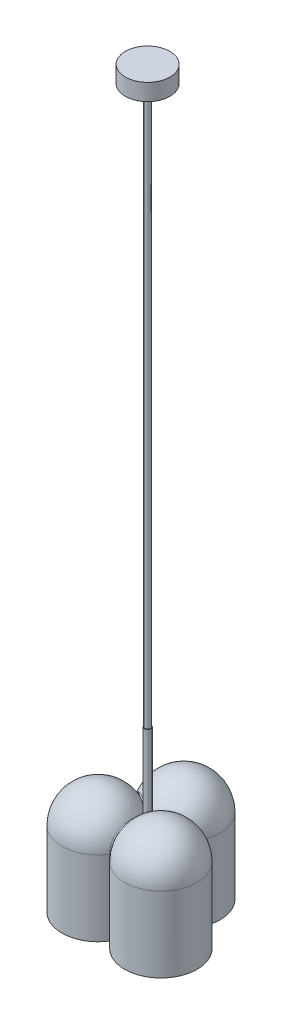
ISO-10303-21;
HEADER;
FILE_DESCRIPTION(('STEP AP214'),'2;1');
FILE_NAME('part.step','',(''),(''),'','','');
FILE_SCHEMA(('AUTOMOTIVE_DESIGN { 1 0 10303 214 1 1 1 1 }'));
ENDSEC;
DATA;
#1=APPLICATION_CONTEXT('core data for automotive mechanical design processes');
#2=APPLICATION_PROTOCOL_DEFINITION('international standard','automotive_design',2000,#1);
#3=PRODUCT_CONTEXT('',#1,'mechanical');
#4=PRODUCT('Part','Part','',(#3));
#5=PRODUCT_RELATED_PRODUCT_CATEGORY('part','',(#4));
#6=PRODUCT_DEFINITION_FORMATION('','',#4);
#7=PRODUCT_DEFINITION_CONTEXT('part definition',#1,'design');
#8=PRODUCT_DEFINITION('design','',#6,#7);
#9=PRODUCT_DEFINITION_SHAPE('','',#8);
#10=(LENGTH_UNIT() NAMED_UNIT(*) SI_UNIT(.MILLI.,.METRE.));
#11=(NAMED_UNIT(*) PLANE_ANGLE_UNIT() SI_UNIT($,.RADIAN.));
#12=(NAMED_UNIT(*) SI_UNIT($,.STERADIAN.) SOLID_ANGLE_UNIT());
#13=UNCERTAINTY_MEASURE_WITH_UNIT(LENGTH_MEASURE(1.E-05),#10,'distance_accuracy_value','');
#14=(GEOMETRIC_REPRESENTATION_CONTEXT(3) GLOBAL_UNCERTAINTY_ASSIGNED_CONTEXT((#13)) GLOBAL_UNIT_ASSIGNED_CONTEXT((#10,
#11,#12)) REPRESENTATION_CONTEXT('',''));
#15=CARTESIAN_POINT('',(0.,0.,0.));
#16=DIRECTION('',(0.,0.,1.));
#17=DIRECTION('',(1.,0.,0.));
#18=AXIS2_PLACEMENT_3D('',#15,#16,#17);
#19=CARTESIAN_POINT('',(0.,95.,0.));
#20=DIRECTION('',(0.,-1.,0.));
#21=DIRECTION('',(0.,0.,-1.));
#22=AXIS2_PLACEMENT_3D('',#19,#20,#21);
#23=PLANE('',#22);
#24=CARTESIAN_POINT('',(0.,95.,0.));
#25=DIRECTION('',(0.,-1.,0.));
#26=DIRECTION('',(0.,0.,-1.));
#27=AXIS2_PLACEMENT_3D('',#24,#25,#26);
#28=CIRCLE('',#27,50.);
#29=CARTESIAN_POINT('',(0.,95.,-50.));
#30=VERTEX_POINT('',#29);
#31=EDGE_CURVE('E11',#30,#30,#28,.T.);
#32=ORIENTED_EDGE('',*,*,#31,.T.);
#33=EDGE_LOOP('',(#32));
#34=FACE_BOUND('',#33,.T.);
#35=CARTESIAN_POINT('',(0.,95.,0.));
#36=DIRECTION('',(0.,-1.,0.));
#37=DIRECTION('',(0.,0.,-1.));
#38=AXIS2_PLACEMENT_3D('',#35,#36,#37);
#39=CIRCLE('',#38,6.);
#40=CARTESIAN_POINT('',(0.,95.,-6.));
#41=VERTEX_POINT('',#40);
#42=EDGE_CURVE('E52',#41,#41,#39,.T.);
#43=ORIENTED_EDGE('',*,*,#42,.F.);
#44=EDGE_LOOP('',(#43));
#45=FACE_BOUND('',#44,.T.);
#46=ADVANCED_FACE('F41',(#34,#45),#23,.T.);
#47=CARTESIAN_POINT('',(0.,98.,0.));
#48=DIRECTION('',(0.,-1.,0.));
#49=DIRECTION('',(0.,0.,-1.));
#50=AXIS2_PLACEMENT_3D('',#47,#48,#49);
#51=PLANE('',#50);
#52=CARTESIAN_POINT('',(0.,98.,0.));
#53=DIRECTION('',(0.,-1.,0.));
#54=DIRECTION('',(0.,0.,-1.));
#55=AXIS2_PLACEMENT_3D('',#52,#53,#54);
#56=CIRCLE('',#55,50.);
#57=CARTESIAN_POINT('',(0.,98.,-50.));
#58=VERTEX_POINT('',#57);
#59=EDGE_CURVE('E45',#58,#58,#56,.T.);
#60=ORIENTED_EDGE('',*,*,#59,.F.);
#61=EDGE_LOOP('',(#60));
#62=FACE_BOUND('',#61,.T.);
#63=CARTESIAN_POINT('',(0.,98.,0.));
#64=DIRECTION('',(0.,-1.,0.));
#65=DIRECTION('',(0.,0.,-1.));
#66=AXIS2_PLACEMENT_3D('',#63,#64,#65);
#67=CIRCLE('',#66,6.);
#68=CARTESIAN_POINT('',(0.,98.,-6.));
#69=VERTEX_POINT('',#68);
#70=EDGE_CURVE('E54',#69,#69,#67,.T.);
#71=ORIENTED_EDGE('',*,*,#70,.T.);
#72=EDGE_LOOP('',(#71));
#73=FACE_BOUND('',#72,.T.);
#74=ADVANCED_FACE('F64',(#62,#73),#51,.F.);
#75=CARTESIAN_POINT('',(0.,95.,0.));
#76=DIRECTION('',(0.,1.,0.));
#77=DIRECTION('',(0.,0.,1.));
#78=AXIS2_PLACEMENT_3D('',#75,#76,#77);
#79=CYLINDRICAL_SURFACE('',#78,50.);
#80=ORIENTED_EDGE('',*,*,#31,.F.);
#81=EDGE_LOOP('',(#80));
#82=FACE_BOUND('',#81,.T.);
#83=ORIENTED_EDGE('',*,*,#59,.T.);
#84=EDGE_LOOP('',(#83));
#85=FACE_BOUND('',#84,.T.);
#86=ADVANCED_FACE('F43',(#82,#85),#79,.T.);
#87=CARTESIAN_POINT('',(0.,95.,0.));
#88=DIRECTION('',(0.,1.,0.));
#89=DIRECTION('',(0.,0.,1.));
#90=AXIS2_PLACEMENT_3D('',#87,#88,#89);
#91=CYLINDRICAL_SURFACE('',#90,6.);
#92=ORIENTED_EDGE('',*,*,#42,.T.);
#93=EDGE_LOOP('',(#92));
#94=FACE_BOUND('',#93,.T.);
#95=ORIENTED_EDGE('',*,*,#70,.F.);
#96=EDGE_LOOP('',(#95));
#97=FACE_BOUND('',#96,.T.);
#98=ADVANCED_FACE('F60',(#94,#97),#91,.F.);
#99=CLOSED_SHELL('',(#46,#74,#86,#98));
#100=MANIFOLD_SOLID_BREP('B2',#99);
#101=CARTESIAN_POINT('',(0.,98.,0.));
#102=DIRECTION('',(0.,1.,0.));
#103=DIRECTION('',(0.,0.,1.));
#104=AXIS2_PLACEMENT_3D('',#101,#102,#103);
#105=CYLINDRICAL_SURFACE('',#104,50.);
#106=CARTESIAN_POINT('',(0.,98.,0.));
#107=DIRECTION('',(0.,1.,0.));
#108=DIRECTION('',(0.,0.,1.));
#109=AXIS2_PLACEMENT_3D('',#106,#107,#108);
#110=CIRCLE('',#109,50.);
#111=CARTESIAN_POINT('',(0.,98.,50.));
#112=VERTEX_POINT('',#111);
#113=EDGE_CURVE('E40',#112,#112,#110,.T.);
#114=ORIENTED_EDGE('',*,*,#113,.T.);
#115=EDGE_LOOP('',(#114));
#116=FACE_BOUND('',#115,.T.);
#117=CARTESIAN_POINT('',(0.,120.,0.));
#118=DIRECTION('',(0.,1.,0.));
#119=DIRECTION('',(0.,0.,1.));
#120=AXIS2_PLACEMENT_3D('',#117,#118,#119);
#121=CIRCLE('',#120,50.);
#122=CARTESIAN_POINT('',(0.,120.,50.));
#123=VERTEX_POINT('',#122);
#124=EDGE_CURVE('E113',#123,#123,#121,.T.);
#125=ORIENTED_EDGE('',*,*,#124,.F.);
#126=EDGE_LOOP('',(#125));
#127=FACE_BOUND('',#126,.T.);
#128=ADVANCED_FACE('F110',(#116,#127),#105,.T.);
#129=CARTESIAN_POINT('',(0.,98.,0.));
#130=DIRECTION('',(0.,1.,0.));
#131=DIRECTION('',(0.,0.,1.));
#132=AXIS2_PLACEMENT_3D('',#129,#130,#131);
#133=PLANE('',#132);
#134=CARTESIAN_POINT('',(0.,98.,0.));
#135=DIRECTION('',(0.,1.,0.));
#136=DIRECTION('',(0.,0.,1.));
#137=AXIS2_PLACEMENT_3D('',#134,#135,#136);
#138=CIRCLE('',#137,6.);
#139=CARTESIAN_POINT('',(0.,98.,6.));
#140=VERTEX_POINT('',#139);
#141=EDGE_CURVE('E120',#140,#140,#138,.T.);
#142=ORIENTED_EDGE('',*,*,#141,.T.);
#143=EDGE_LOOP('',(#142));
#144=FACE_BOUND('',#143,.T.);
#145=ORIENTED_EDGE('',*,*,#113,.F.);
#146=EDGE_LOOP('',(#145));
#147=FACE_BOUND('',#146,.T.);
#148=ADVANCED_FACE('F128',(#144,#147),#133,.F.);
#149=CARTESIAN_POINT('',(0.,120.,0.));
#150=DIRECTION('',(0.,1.,0.));
#151=DIRECTION('',(0.,0.,1.));
#152=AXIS2_PLACEMENT_3D('',#149,#150,#151);
#153=PLANE('',#152);
#154=CARTESIAN_POINT('',(0.,120.,0.));
#155=DIRECTION('',(0.,1.,0.));
#156=DIRECTION('',(0.,0.,1.));
#157=AXIS2_PLACEMENT_3D('',#154,#155,#156);
#158=CIRCLE('',#157,6.);
#159=CARTESIAN_POINT('',(0.,120.,6.));
#160=VERTEX_POINT('',#159);
#161=EDGE_CURVE('E122',#160,#160,#158,.T.);
#162=ORIENTED_EDGE('',*,*,#161,.F.);
#163=EDGE_LOOP('',(#162));
#164=FACE_BOUND('',#163,.T.);
#165=ORIENTED_EDGE('',*,*,#124,.T.);
#166=EDGE_LOOP('',(#165));
#167=FACE_BOUND('',#166,.T.);
#168=ADVANCED_FACE('F134',(#164,#167),#153,.T.);
#169=CARTESIAN_POINT('',(0.,98.,0.));
#170=DIRECTION('',(0.,1.,0.));
#171=DIRECTION('',(0.,0.,1.));
#172=AXIS2_PLACEMENT_3D('',#169,#170,#171);
#173=CYLINDRICAL_SURFACE('',#172,6.);
#174=ORIENTED_EDGE('',*,*,#141,.F.);
#175=EDGE_LOOP('',(#174));
#176=FACE_BOUND('',#175,.T.);
#177=ORIENTED_EDGE('',*,*,#161,.T.);
#178=EDGE_LOOP('',(#177));
#179=FACE_BOUND('',#178,.T.);
#180=ADVANCED_FACE('F131',(#176,#179),#173,.F.);
#181=CLOSED_SHELL('',(#128,#148,#168,#180));
#182=MANIFOLD_SOLID_BREP('B6',#181);
#183=CARTESIAN_POINT('',(0.,1330.,0.));
#184=DIRECTION('',(0.,-1.,0.));
#185=DIRECTION('',(0.,0.,-1.));
#186=AXIS2_PLACEMENT_3D('',#183,#184,#185);
#187=CYLINDRICAL_SURFACE('',#186,40.);
#188=CARTESIAN_POINT('',(0.,1330.,0.));
#189=DIRECTION('',(0.,1.,0.));
#190=DIRECTION('',(0.,0.,1.));
#191=AXIS2_PLACEMENT_3D('',#188,#189,#190);
#192=CIRCLE('',#191,40.);
#193=CARTESIAN_POINT('',(0.,1330.,40.));
#194=VERTEX_POINT('',#193);
#195=EDGE_CURVE('E109',#194,#194,#192,.T.);
#196=ORIENTED_EDGE('',*,*,#195,.F.);
#197=EDGE_LOOP('',(#196));
#198=FACE_BOUND('',#197,.T.);
#199=CARTESIAN_POINT('',(0.,1300.,0.));
#200=DIRECTION('',(0.,1.,0.));
#201=DIRECTION('',(0.,0.,1.));
#202=AXIS2_PLACEMENT_3D('',#199,#200,#201);
#203=CIRCLE('',#202,40.);
#204=CARTESIAN_POINT('',(0.,1300.,40.));
#205=VERTEX_POINT('',#204);
#206=EDGE_CURVE('E182',#205,#205,#203,.T.);
#207=ORIENTED_EDGE('',*,*,#206,.T.);
#208=EDGE_LOOP('',(#207));
#209=FACE_BOUND('',#208,.T.);
#210=ADVANCED_FACE('F179',(#198,#209),#187,.T.);
#211=CARTESIAN_POINT('',(0.,1330.,0.));
#212=DIRECTION('',(0.,1.,0.));
#213=DIRECTION('',(0.,0.,1.));
#214=AXIS2_PLACEMENT_3D('',#211,#212,#213);
#215=PLANE('',#214);
#216=ORIENTED_EDGE('',*,*,#195,.T.);
#217=EDGE_LOOP('',(#216));
#218=FACE_BOUND('',#217,.T.);
#219=ADVANCED_FACE('F194',(#218),#215,.T.);
#220=CARTESIAN_POINT('',(0.,1300.,0.));
#221=DIRECTION('',(0.,1.,0.));
#222=DIRECTION('',(0.,0.,1.));
#223=AXIS2_PLACEMENT_3D('',#220,#221,#222);
#224=PLANE('',#223);
#225=ORIENTED_EDGE('',*,*,#206,.F.);
#226=EDGE_LOOP('',(#225));
#227=FACE_BOUND('',#226,.T.);
#228=ADVANCED_FACE('F192',(#227),#224,.F.);
#229=CLOSED_SHELL('',(#210,#219,#228));
#230=MANIFOLD_SOLID_BREP('B35',#229);
#231=CARTESIAN_POINT('',(0.,1300.,0.));
#232=DIRECTION('',(0.,-1.,0.));
#233=DIRECTION('',(0.,0.,-1.));
#234=AXIS2_PLACEMENT_3D('',#231,#232,#233);
#235=CYLINDRICAL_SURFACE('',#234,5.);
#236=CARTESIAN_POINT('',(0.,1300.,0.));
#237=DIRECTION('',(0.,1.,0.));
#238=DIRECTION('',(0.,0.,1.));
#239=AXIS2_PLACEMENT_3D('',#236,#237,#238);
#240=CIRCLE('',#239,5.);
#241=CARTESIAN_POINT('',(0.,1300.,5.));
#242=VERTEX_POINT('',#241);
#243=EDGE_CURVE('E178',#242,#242,#240,.T.);
#244=ORIENTED_EDGE('',*,*,#243,.F.);
#245=EDGE_LOOP('',(#244));
#246=FACE_BOUND('',#245,.T.);
#247=CARTESIAN_POINT('',(0.,300.,0.));
#248=DIRECTION('',(0.,1.,0.));
#249=DIRECTION('',(0.,0.,1.));
#250=AXIS2_PLACEMENT_3D('',#247,#248,#249);
#251=CIRCLE('',#250,5.);
#252=CARTESIAN_POINT('',(0.,300.,5.));
#253=VERTEX_POINT('',#252);
#254=EDGE_CURVE('E230',#253,#253,#251,.T.);
#255=ORIENTED_EDGE('',*,*,#254,.T.);
#256=EDGE_LOOP('',(#255));
#257=FACE_BOUND('',#256,.T.);
#258=ADVANCED_FACE('F227',(#246,#257),#235,.T.);
#259=CARTESIAN_POINT('',(0.,1300.,0.));
#260=DIRECTION('',(0.,1.,0.));
#261=DIRECTION('',(0.,0.,1.));
#262=AXIS2_PLACEMENT_3D('',#259,#260,#261);
#263=PLANE('',#262);
#264=ORIENTED_EDGE('',*,*,#243,.T.);
#265=EDGE_LOOP('',(#264));
#266=FACE_BOUND('',#265,.T.);
#267=ADVANCED_FACE('F242',(#266),#263,.T.);
#268=CARTESIAN_POINT('',(0.,300.,0.));
#269=DIRECTION('',(0.,1.,0.));
#270=DIRECTION('',(0.,0.,1.));
#271=AXIS2_PLACEMENT_3D('',#268,#269,#270);
#272=PLANE('',#271);
#273=ORIENTED_EDGE('',*,*,#254,.F.);
#274=EDGE_LOOP('',(#273));
#275=FACE_BOUND('',#274,.T.);
#276=ADVANCED_FACE('F240',(#275),#272,.F.);
#277=CLOSED_SHELL('',(#258,#267,#276));
#278=MANIFOLD_SOLID_BREP('B104',#277);
#279=CARTESIAN_POINT('',(0.,316.970562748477,0.));
#280=DIRECTION('',(0.,-1.,0.));
#281=DIRECTION('',(0.,0.,-1.));
#282=AXIS2_PLACEMENT_3D('',#279,#280,#281);
#283=CYLINDRICAL_SURFACE('',#282,6.);
#284=CARTESIAN_POINT('',(0.,300.,0.));
#285=DIRECTION('',(0.,1.,0.));
#286=DIRECTION('',(0.,0.,1.));
#287=AXIS2_PLACEMENT_3D('',#284,#285,#286);
#288=CIRCLE('',#287,6.);
#289=CARTESIAN_POINT('',(0.,300.,6.));
#290=VERTEX_POINT('',#289);
#291=EDGE_CURVE('E226',#290,#290,#288,.T.);
#292=ORIENTED_EDGE('',*,*,#291,.F.);
#293=EDGE_LOOP('',(#292));
#294=FACE_BOUND('',#293,.T.);
#295=CARTESIAN_POINT('',(0.,-50.,0.));
#296=DIRECTION('',(0.,1.,0.));
#297=DIRECTION('',(0.,0.,1.));
#298=AXIS2_PLACEMENT_3D('',#295,#296,#297);
#299=CIRCLE('',#298,6.);
#300=CARTESIAN_POINT('',(0.,-50.,6.));
#301=VERTEX_POINT('',#300);
#302=EDGE_CURVE('E283',#301,#301,#299,.F.);
#303=ORIENTED_EDGE('',*,*,#302,.F.);
#304=EDGE_LOOP('',(#303));
#305=FACE_BOUND('',#304,.T.);
#306=ADVANCED_FACE('F276',(#294,#305),#283,.T.);
#307=CARTESIAN_POINT('',(0.,300.,0.));
#308=DIRECTION('',(0.,1.,0.));
#309=DIRECTION('',(0.,0.,1.));
#310=AXIS2_PLACEMENT_3D('',#307,#308,#309);
#311=PLANE('',#310);
#312=ORIENTED_EDGE('',*,*,#291,.T.);
#313=EDGE_LOOP('',(#312));
#314=FACE_BOUND('',#313,.T.);
#315=ADVANCED_FACE('F278',(#314),#311,.T.);
#316=CARTESIAN_POINT('',(0.,-50.,0.));
#317=DIRECTION('',(0.,1.,0.));
#318=DIRECTION('',(0.,0.,1.));
#319=AXIS2_PLACEMENT_3D('',#316,#317,#318);
#320=PLANE('',#319);
#321=ORIENTED_EDGE('',*,*,#302,.T.);
#322=EDGE_LOOP('',(#321));
#323=FACE_BOUND('',#322,.T.);
#324=ADVANCED_FACE('F289',(#323),#320,.F.);
#325=CLOSED_SHELL('',(#306,#315,#324));
#326=MANIFOLD_SOLID_BREP('B173',#325);
#327=CARTESIAN_POINT('',(0.,0.,-130.));
#328=DIRECTION('',(0.,-1.,0.));
#329=DIRECTION('',(0.,0.,-1.));
#330=AXIS2_PLACEMENT_3D('',#327,#328,#329);
#331=PLANE('',#330);
#332=CARTESIAN_POINT('',(56.2916512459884,0.,32.5000000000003));
#333=DIRECTION('',(0.,-1.,0.));
#334=DIRECTION('',(0.866025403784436,0.,0.500000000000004));
#335=AXIS2_PLACEMENT_3D('',#332,#333,#334);
#336=CIRCLE('',#335,65.);
#337=CARTESIAN_POINT('',(58.7505399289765,0.,-32.4534746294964));
#338=VERTEX_POINT('',#337);
#339=CARTESIAN_POINT('',(1.26973649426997,0.,67.1061973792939));
#340=VERTEX_POINT('',#339);
#341=EDGE_CURVE('E490',#338,#340,#336,.T.);
#342=ORIENTED_EDGE('',*,*,#341,.T.);
#343=CARTESIAN_POINT('',(-4.68624052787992E-13,0.,67.9048019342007));
#344=DIRECTION('',(0.,-1.,0.));
#345=DIRECTION('',(0.,0.,-1.));
#346=AXIS2_PLACEMENT_3D('',#343,#344,#345);
#347=CIRCLE('',#346,1.5);
#348=CARTESIAN_POINT('',(-1.2697364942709,0.,67.1061973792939));
#349=VERTEX_POINT('',#348);
#350=EDGE_CURVE('E325',#340,#349,#347,.F.);
#351=ORIENTED_EDGE('',*,*,#350,.T.);
#352=CARTESIAN_POINT('',(-56.2916512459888,0.,32.4999999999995));
#353=DIRECTION('',(0.,-1.,0.));
#354=DIRECTION('',(-0.866025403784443,0.,0.499999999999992));
#355=AXIS2_PLACEMENT_3D('',#352,#353,#354);
#356=CIRCLE('',#355,65.);
#357=CARTESIAN_POINT('',(-58.750539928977,0.,-32.4534746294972));
#358=VERTEX_POINT('',#357);
#359=EDGE_CURVE('E484',#349,#358,#356,.T.);
#360=ORIENTED_EDGE('',*,*,#359,.T.);
#361=CARTESIAN_POINT('',(-58.807283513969,0.,-33.952400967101));
#362=DIRECTION('',(0.,-1.,0.));
#363=DIRECTION('',(0.,0.,-1.));
#364=AXIS2_PLACEMENT_3D('',#361,#362,#363);
#365=CIRCLE('',#364,1.5);
#366=CARTESIAN_POINT('',(-57.4808034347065,0.,-34.652722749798));
#367=VERTEX_POINT('',#366);
#368=EDGE_CURVE('E523',#358,#367,#365,.F.);
#369=ORIENTED_EDGE('',*,*,#368,.T.);
#370=CARTESIAN_POINT('',(0.,0.,-65.));
#371=DIRECTION('',(0.,-1.,0.));
#372=DIRECTION('',(0.,0.,-1.));
#373=AXIS2_PLACEMENT_3D('',#370,#371,#372);
#374=CIRCLE('',#373,65.);
#375=CARTESIAN_POINT('',(57.4808034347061,0.,-34.6527227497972));
#376=VERTEX_POINT('',#375);
#377=EDGE_CURVE('E496',#367,#376,#374,.T.);
#378=ORIENTED_EDGE('',*,*,#377,.T.);
#379=CARTESIAN_POINT('',(58.8072835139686,0.,-33.9524009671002));
#380=DIRECTION('',(0.,-1.,0.));
#381=DIRECTION('',(0.,0.,-1.));
#382=AXIS2_PLACEMENT_3D('',#379,#380,#381);
#383=CIRCLE('',#382,1.5);
#384=EDGE_CURVE('E274',#376,#338,#383,.F.);
#385=ORIENTED_EDGE('',*,*,#384,.T.);
#386=EDGE_LOOP('',(#342,#351,#360,#369,#378,#385));
#387=FACE_BOUND('',#386,.T.);
#388=CARTESIAN_POINT('',(56.2916512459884,0.,32.5000000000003));
#389=DIRECTION('',(0.,-1.,0.));
#390=DIRECTION('',(0.,0.,-1.));
#391=AXIS2_PLACEMENT_3D('',#388,#389,#390);
#392=CIRCLE('',#391,62.);
#393=CARTESIAN_POINT('',(58.6370527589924,0.,-29.4556219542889));
#394=VERTEX_POINT('',#393);
#395=CARTESIAN_POINT('',(3.80920948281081,0.,65.5089882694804));
#396=VERTEX_POINT('',#395);
#397=EDGE_CURVE('E444',#394,#396,#392,.T.);
#398=ORIENTED_EDGE('',*,*,#397,.F.);
#399=CARTESIAN_POINT('',(58.8072835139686,0.,-33.9524009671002));
#400=DIRECTION('',(0.,-1.,0.));
#401=DIRECTION('',(0.,0.,-1.));
#402=AXIS2_PLACEMENT_3D('',#399,#400,#401);
#403=CIRCLE('',#402,4.5);
#404=CARTESIAN_POINT('',(54.8278432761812,0.,-36.0533663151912));
#405=VERTEX_POINT('',#404);
#406=EDGE_CURVE('E467',#405,#394,#403,.F.);
#407=ORIENTED_EDGE('',*,*,#406,.F.);
#408=CARTESIAN_POINT('',(0.,0.,-65.));
#409=DIRECTION('',(0.,-1.,0.));
#410=DIRECTION('',(0.,0.,-1.));
#411=AXIS2_PLACEMENT_3D('',#408,#409,#410);
#412=CIRCLE('',#411,62.);
#413=CARTESIAN_POINT('',(-54.8278432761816,0.,-36.0533663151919));
#414=VERTEX_POINT('',#413);
#415=EDGE_CURVE('E333',#414,#405,#412,.T.);
#416=ORIENTED_EDGE('',*,*,#415,.F.);
#417=CARTESIAN_POINT('',(-58.807283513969,0.,-33.952400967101));
#418=DIRECTION('',(0.,-1.,0.));
#419=DIRECTION('',(0.,0.,-1.));
#420=AXIS2_PLACEMENT_3D('',#417,#418,#419);
#421=CIRCLE('',#420,4.5);
#422=CARTESIAN_POINT('',(-58.6370527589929,0.,-29.4556219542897));
#423=VERTEX_POINT('',#422);
#424=EDGE_CURVE('E433',#423,#414,#421,.F.);
#425=ORIENTED_EDGE('',*,*,#424,.F.);
#426=CARTESIAN_POINT('',(-56.2916512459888,0.,32.4999999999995));
#427=DIRECTION('',(0.,-1.,0.));
#428=DIRECTION('',(0.,0.,-1.));
#429=AXIS2_PLACEMENT_3D('',#426,#427,#428);
#430=CIRCLE('',#429,62.);
#431=CARTESIAN_POINT('',(-3.80920948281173,0.,65.5089882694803));
#432=VERTEX_POINT('',#431);
#433=EDGE_CURVE('E475',#432,#423,#430,.T.);
#434=ORIENTED_EDGE('',*,*,#433,.F.);
#435=CARTESIAN_POINT('',(-4.68624052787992E-13,0.,67.9048019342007));
#436=DIRECTION('',(0.,-1.,0.));
#437=DIRECTION('',(0.,0.,-1.));
#438=AXIS2_PLACEMENT_3D('',#435,#436,#437);
#439=CIRCLE('',#438,4.5);
#440=EDGE_CURVE('E470',#396,#432,#439,.F.);
#441=ORIENTED_EDGE('',*,*,#440,.F.);
#442=EDGE_LOOP('',(#398,#407,#416,#425,#434,#441));
#443=FACE_BOUND('',#442,.T.);
#444=ADVANCED_FACE('F316',(#387,#443),#331,.T.);
#445=CARTESIAN_POINT('',(0.,0.,-65.));
#446=DIRECTION('',(0.,-1.,0.));
#447=DIRECTION('',(0.,0.,-1.));
#448=AXIS2_PLACEMENT_3D('',#445,#446,#447);
#449=CYLINDRICAL_SURFACE('',#448,65.);
#450=ORIENTED_EDGE('',*,*,#377,.F.);
#451=DIRECTION('',(0.,-1.,0.));
#452=VECTOR('',#451,1.);
#453=CARTESIAN_POINT('',(-57.4808034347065,0.,-34.652722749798));
#454=LINE('',#453,#452);
#455=CARTESIAN_POINT('',(-57.4808034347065,135.,-34.652722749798));
#456=VERTEX_POINT('',#455);
#457=EDGE_CURVE('E506',#367,#456,#454,.F.);
#458=ORIENTED_EDGE('',*,*,#457,.T.);
#459=CARTESIAN_POINT('',(0.,135.,-65.));
#460=DIRECTION('',(0.,-1.,0.));
#461=DIRECTION('',(0.,0.,-1.));
#462=AXIS2_PLACEMENT_3D('',#459,#460,#461);
#463=CIRCLE('',#462,65.);
#464=CARTESIAN_POINT('',(57.4808034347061,135.,-34.6527227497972));
#465=VERTEX_POINT('',#464);
#466=EDGE_CURVE('E493',#456,#465,#463,.T.);
#467=ORIENTED_EDGE('',*,*,#466,.T.);
#468=DIRECTION('',(0.,-1.,0.));
#469=VECTOR('',#468,1.);
#470=CARTESIAN_POINT('',(57.4808034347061,0.,-34.6527227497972));
#471=LINE('',#470,#469);
#472=EDGE_CURVE('E504',#465,#376,#471,.T.);
#473=ORIENTED_EDGE('',*,*,#472,.T.);
#474=EDGE_LOOP('',(#450,#458,#467,#473));
#475=FACE_BOUND('',#474,.T.);
#476=ADVANCED_FACE('F553',(#475),#449,.T.);
#477=CARTESIAN_POINT('',(0.,135.,-65.));
#478=DIRECTION('',(0.,-1.,0.));
#479=DIRECTION('',(0.,0.,-1.));
#480=AXIS2_PLACEMENT_3D('',#477,#478,#479);
#481=SPHERICAL_SURFACE('',#480,65.);
#482=ORIENTED_EDGE('',*,*,#466,.F.);
#483=CARTESIAN_POINT('',(-27.5109573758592,135.,-17.3496240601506));
#484=DIRECTION('',(0.500000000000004,0.,-0.866025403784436));
#485=DIRECTION('',(-0.866025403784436,0.,-0.500000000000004));
#486=AXIS2_PLACEMENT_3D('',#483,#484,#485);
#487=CIRCLE('',#486,34.6061973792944);
#488=CARTESIAN_POINT('',(0.,148.727777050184,-1.46616541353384));
#489=VERTEX_POINT('',#488);
#490=EDGE_CURVE('E518',#456,#489,#487,.T.);
#491=ORIENTED_EDGE('',*,*,#490,.T.);
#492=CARTESIAN_POINT('',(27.510957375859,135.,-17.3496240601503));
#493=DIRECTION('',(-0.499999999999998,0.,-0.86602540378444));
#494=DIRECTION('',(-0.86602540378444,0.,0.499999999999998));
#495=AXIS2_PLACEMENT_3D('',#492,#493,#494);
#496=CIRCLE('',#495,34.6061973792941);
#497=EDGE_CURVE('E516',#489,#465,#496,.T.);
#498=ORIENTED_EDGE('',*,*,#497,.T.);
#499=EDGE_LOOP('',(#482,#491,#498));
#500=FACE_BOUND('',#499,.T.);
#501=ADVANCED_FACE('F575',(#500),#481,.T.);
#502=CARTESIAN_POINT('',(56.2916512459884,0.,32.5000000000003));
#503=DIRECTION('',(0.,-1.,0.));
#504=DIRECTION('',(0.866025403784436,0.,0.500000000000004));
#505=AXIS2_PLACEMENT_3D('',#502,#503,#504);
#506=CYLINDRICAL_SURFACE('',#505,65.);
#507=CARTESIAN_POINT('',(56.2916512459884,135.,32.5000000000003));
#508=DIRECTION('',(0.,-1.,0.));
#509=DIRECTION('',(0.866025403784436,0.,0.500000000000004));
#510=AXIS2_PLACEMENT_3D('',#507,#508,#509);
#511=CIRCLE('',#510,65.);
#512=CARTESIAN_POINT('',(58.7505399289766,135.,-32.4534746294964));
#513=VERTEX_POINT('',#512);
#514=CARTESIAN_POINT('',(1.26973649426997,135.,67.1061973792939));
#515=VERTEX_POINT('',#514);
#516=EDGE_CURVE('E487',#513,#515,#511,.T.);
#517=ORIENTED_EDGE('',*,*,#516,.T.);
#518=DIRECTION('',(0.,-1.,0.));
#519=VECTOR('',#518,1.);
#520=CARTESIAN_POINT('',(1.26973649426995,0.,67.1061973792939));
#521=LINE('',#520,#519);
#522=EDGE_CURVE('E510',#515,#340,#521,.T.);
#523=ORIENTED_EDGE('',*,*,#522,.T.);
#524=ORIENTED_EDGE('',*,*,#341,.F.);
#525=DIRECTION('',(0.,-1.,0.));
#526=VECTOR('',#525,1.);
#527=CARTESIAN_POINT('',(58.7505399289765,0.,-32.4534746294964));
#528=LINE('',#527,#526);
#529=EDGE_CURVE('E508',#338,#513,#528,.F.);
#530=ORIENTED_EDGE('',*,*,#529,.T.);
#531=EDGE_LOOP('',(#517,#523,#524,#530));
#532=FACE_BOUND('',#531,.T.);
#533=ADVANCED_FACE('F577',(#532),#506,.T.);
#534=CARTESIAN_POINT('',(56.2916512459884,135.,32.5000000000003));
#535=DIRECTION('',(0.,-1.,0.));
#536=DIRECTION('',(0.866025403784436,0.,0.500000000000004));
#537=AXIS2_PLACEMENT_3D('',#534,#535,#536);
#538=SPHERICAL_SURFACE('',#537,65.);
#539=CARTESIAN_POINT('',(28.7806938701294,135.,-15.1503759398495));
#540=DIRECTION('',(0.499999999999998,0.,0.86602540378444));
#541=DIRECTION('',(0.86602540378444,0.,-0.499999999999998));
#542=AXIS2_PLACEMENT_3D('',#539,#540,#541);
#543=CIRCLE('',#542,34.6061973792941);
#544=CARTESIAN_POINT('',(1.26973649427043,148.727777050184,0.733082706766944));
#545=VERTEX_POINT('',#544);
#546=EDGE_CURVE('E341',#513,#545,#543,.T.);
#547=ORIENTED_EDGE('',*,*,#546,.T.);
#548=CARTESIAN_POINT('',(1.26973649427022,135.,32.4999999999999));
#549=DIRECTION('',(1.,0.,0.));
#550=DIRECTION('',(0.,0.,-1.));
#551=AXIS2_PLACEMENT_3D('',#548,#549,#550);
#552=CIRCLE('',#551,34.6061973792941);
#553=EDGE_CURVE('E521',#545,#515,#552,.T.);
#554=ORIENTED_EDGE('',*,*,#553,.T.);
#555=ORIENTED_EDGE('',*,*,#516,.F.);
#556=EDGE_LOOP('',(#547,#554,#555));
#557=FACE_BOUND('',#556,.T.);
#558=ADVANCED_FACE('F583',(#557),#538,.T.);
#559=CARTESIAN_POINT('',(-56.2916512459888,0.,32.4999999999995));
#560=DIRECTION('',(0.,-1.,0.));
#561=DIRECTION('',(-0.866025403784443,0.,0.499999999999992));
#562=AXIS2_PLACEMENT_3D('',#559,#560,#561);
#563=CYLINDRICAL_SURFACE('',#562,65.);
#564=CARTESIAN_POINT('',(-56.2916512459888,135.,32.4999999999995));
#565=DIRECTION('',(0.,-1.,0.));
#566=DIRECTION('',(-0.866025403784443,0.,0.499999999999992));
#567=AXIS2_PLACEMENT_3D('',#564,#565,#566);
#568=CIRCLE('',#567,65.);
#569=CARTESIAN_POINT('',(-1.26973649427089,135.,67.1061973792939));
#570=VERTEX_POINT('',#569);
#571=CARTESIAN_POINT('',(-58.750539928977,135.,-32.4534746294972));
#572=VERTEX_POINT('',#571);
#573=EDGE_CURVE('E481',#570,#572,#568,.T.);
#574=ORIENTED_EDGE('',*,*,#573,.T.);
#575=DIRECTION('',(0.,-1.,0.));
#576=VECTOR('',#575,1.);
#577=CARTESIAN_POINT('',(-58.750539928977,0.,-32.4534746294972));
#578=LINE('',#577,#576);
#579=EDGE_CURVE('E501',#572,#358,#578,.T.);
#580=ORIENTED_EDGE('',*,*,#579,.T.);
#581=ORIENTED_EDGE('',*,*,#359,.F.);
#582=DIRECTION('',(0.,-1.,0.));
#583=VECTOR('',#582,1.);
#584=CARTESIAN_POINT('',(-1.26973649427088,0.,67.1061973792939));
#585=LINE('',#584,#583);
#586=EDGE_CURVE('E499',#349,#570,#585,.F.);
#587=ORIENTED_EDGE('',*,*,#586,.T.);
#588=EDGE_LOOP('',(#574,#580,#581,#587));
#589=FACE_BOUND('',#588,.T.);
#590=ADVANCED_FACE('F564',(#589),#563,.T.);
#591=CARTESIAN_POINT('',(-56.2916512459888,135.,32.4999999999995));
#592=DIRECTION('',(0.,-1.,0.));
#593=DIRECTION('',(-0.866025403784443,0.,0.499999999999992));
#594=AXIS2_PLACEMENT_3D('',#591,#592,#593);
#595=SPHERICAL_SURFACE('',#594,65.);
#596=CARTESIAN_POINT('',(-1.26973649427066,135.,32.4999999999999));
#597=DIRECTION('',(-1.,0.,0.));
#598=DIRECTION('',(0.,0.,1.));
#599=AXIS2_PLACEMENT_3D('',#596,#597,#598);
#600=CIRCLE('',#599,34.6061973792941);
#601=CARTESIAN_POINT('',(-1.26973649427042,148.727777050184,0.733082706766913));
#602=VERTEX_POINT('',#601);
#603=EDGE_CURVE('E512',#570,#602,#600,.T.);
#604=ORIENTED_EDGE('',*,*,#603,.T.);
#605=CARTESIAN_POINT('',(-28.7806938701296,135.,-15.1503759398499));
#606=DIRECTION('',(-0.500000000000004,0.,0.866025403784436));
#607=DIRECTION('',(0.866025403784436,0.,0.500000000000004));
#608=AXIS2_PLACEMENT_3D('',#605,#606,#607);
#609=CIRCLE('',#608,34.6061973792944);
#610=EDGE_CURVE('E514',#602,#572,#609,.T.);
#611=ORIENTED_EDGE('',*,*,#610,.T.);
#612=ORIENTED_EDGE('',*,*,#573,.F.);
#613=EDGE_LOOP('',(#604,#611,#612));
#614=FACE_BOUND('',#613,.T.);
#615=ADVANCED_FACE('F610',(#614),#595,.T.);
#616=CARTESIAN_POINT('',(58.8072835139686,0.,-33.9524009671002));
#617=DIRECTION('',(0.,-1.,0.));
#618=DIRECTION('',(0.,0.,-1.));
#619=AXIS2_PLACEMENT_3D('',#616,#617,#618);
#620=CYLINDRICAL_SURFACE('',#619,1.5);
#621=ORIENTED_EDGE('',*,*,#384,.F.);
#622=ORIENTED_EDGE('',*,*,#472,.F.);
#623=CARTESIAN_POINT('',(58.8072835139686,135.,-33.9524009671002));
#624=DIRECTION('',(0.,-1.,0.));
#625=DIRECTION('',(0.,0.,-1.));
#626=AXIS2_PLACEMENT_3D('',#623,#624,#625);
#627=CIRCLE('',#626,1.5);
#628=EDGE_CURVE('E320',#513,#465,#627,.T.);
#629=ORIENTED_EDGE('',*,*,#628,.F.);
#630=ORIENTED_EDGE('',*,*,#529,.F.);
#631=EDGE_LOOP('',(#621,#622,#629,#630));
#632=FACE_BOUND('',#631,.T.);
#633=ADVANCED_FACE('F318',(#632),#620,.F.);
#634=CARTESIAN_POINT('',(-4.68624052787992E-13,0.,67.9048019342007));
#635=DIRECTION('',(0.,-1.,0.));
#636=DIRECTION('',(0.,0.,-1.));
#637=AXIS2_PLACEMENT_3D('',#634,#635,#636);
#638=CYLINDRICAL_SURFACE('',#637,1.5);
#639=ORIENTED_EDGE('',*,*,#350,.F.);
#640=ORIENTED_EDGE('',*,*,#522,.F.);
#641=CARTESIAN_POINT('',(-4.80084721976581E-13,135.,67.9048019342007));
#642=DIRECTION('',(0.,-1.,0.));
#643=DIRECTION('',(0.,0.,-1.));
#644=AXIS2_PLACEMENT_3D('',#641,#642,#643);
#645=CIRCLE('',#644,1.5);
#646=EDGE_CURVE('E536',#570,#515,#645,.T.);
#647=ORIENTED_EDGE('',*,*,#646,.F.);
#648=ORIENTED_EDGE('',*,*,#586,.F.);
#649=EDGE_LOOP('',(#639,#640,#647,#648));
#650=FACE_BOUND('',#649,.T.);
#651=ADVANCED_FACE('F604',(#650),#638,.F.);
#652=CARTESIAN_POINT('',(28.1458256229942,135.,-16.2499999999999));
#653=DIRECTION('',(-0.499999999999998,0.,-0.86602540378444));
#654=DIRECTION('',(-0.86602540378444,0.,0.499999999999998));
#655=AXIS2_PLACEMENT_3D('',#652,#653,#654);
#656=TOROIDAL_SURFACE('',#655,35.4048019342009,1.5);
#657=ORIENTED_EDGE('',*,*,#628,.T.);
#658=ORIENTED_EDGE('',*,*,#497,.F.);
#659=CARTESIAN_POINT('',(0.,149.044571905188,0.));
#660=DIRECTION('',(0.343539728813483,0.917954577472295,-0.198342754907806));
#661=DIRECTION('',(-0.936561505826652,0.35050327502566,0.));
#662=AXIS2_PLACEMENT_3D('',#659,#660,#661);
#663=CIRCLE('',#662,1.5);
#664=EDGE_CURVE('E534',#545,#489,#663,.T.);
#665=ORIENTED_EDGE('',*,*,#664,.F.);
#666=ORIENTED_EDGE('',*,*,#546,.F.);
#667=EDGE_LOOP('',(#657,#658,#665,#666));
#668=FACE_BOUND('',#667,.T.);
#669=ADVANCED_FACE('F545',(#668),#656,.F.);
#670=CARTESIAN_POINT('',(-2.22044604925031E-13,135.,32.4999999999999));
#671=DIRECTION('',(1.,0.,0.));
#672=DIRECTION('',(0.,0.,-1.));
#673=AXIS2_PLACEMENT_3D('',#670,#671,#672);
#674=TOROIDAL_SURFACE('',#673,35.4048019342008,1.5);
#675=ORIENTED_EDGE('',*,*,#646,.T.);
#676=ORIENTED_EDGE('',*,*,#553,.F.);
#677=CARTESIAN_POINT('',(0.,149.044571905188,0.));
#678=DIRECTION('',(0.,0.91795457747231,0.396685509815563));
#679=DIRECTION('',(0.,-0.396685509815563,0.91795457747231));
#680=AXIS2_PLACEMENT_3D('',#677,#678,#679);
#681=CIRCLE('',#680,1.5);
#682=EDGE_CURVE('E531',#602,#545,#681,.T.);
#683=ORIENTED_EDGE('',*,*,#682,.F.);
#684=ORIENTED_EDGE('',*,*,#603,.F.);
#685=EDGE_LOOP('',(#675,#676,#683,#684));
#686=FACE_BOUND('',#685,.T.);
#687=ADVANCED_FACE('F599',(#686),#674,.F.);
#688=CARTESIAN_POINT('',(0.,149.044571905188,0.));
#689=DIRECTION('',(0.,0.,1.));
#690=DIRECTION('',(1.,0.,0.));
#691=AXIS2_PLACEMENT_3D('',#688,#689,#690);
#692=SPHERICAL_SURFACE('',#691,1.5);
#693=ORIENTED_EDGE('',*,*,#682,.T.);
#694=ORIENTED_EDGE('',*,*,#664,.T.);
#695=CARTESIAN_POINT('',(0.,149.044571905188,0.));
#696=DIRECTION('',(-0.343539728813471,0.917954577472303,-0.19834275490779));
#697=DIRECTION('',(-0.936561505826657,-0.350503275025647,0.));
#698=AXIS2_PLACEMENT_3D('',#695,#696,#697);
#699=CIRCLE('',#698,1.5);
#700=EDGE_CURVE('E528',#602,#489,#699,.F.);
#701=ORIENTED_EDGE('',*,*,#700,.F.);
#702=EDGE_LOOP('',(#693,#694,#701));
#703=FACE_BOUND('',#702,.T.);
#704=ADVANCED_FACE('F596',(#703),#692,.F.);
#705=CARTESIAN_POINT('',(-28.1458256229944,135.,-16.2500000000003));
#706=DIRECTION('',(0.500000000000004,0.,-0.866025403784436));
#707=DIRECTION('',(-0.866025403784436,0.,-0.500000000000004));
#708=AXIS2_PLACEMENT_3D('',#705,#706,#707);
#709=TOROIDAL_SURFACE('',#708,35.4048019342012,1.5);
#710=ORIENTED_EDGE('',*,*,#700,.T.);
#711=ORIENTED_EDGE('',*,*,#490,.F.);
#712=CARTESIAN_POINT('',(-58.807283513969,135.,-33.952400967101));
#713=DIRECTION('',(0.,1.,0.));
#714=DIRECTION('',(0.,0.,1.));
#715=AXIS2_PLACEMENT_3D('',#712,#713,#714);
#716=CIRCLE('',#715,1.5);
#717=EDGE_CURVE('E469',#572,#456,#716,.T.);
#718=ORIENTED_EDGE('',*,*,#717,.F.);
#719=ORIENTED_EDGE('',*,*,#610,.F.);
#720=EDGE_LOOP('',(#710,#711,#718,#719));
#721=FACE_BOUND('',#720,.T.);
#722=ADVANCED_FACE('F572',(#721),#709,.F.);
#723=CARTESIAN_POINT('',(-58.807283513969,0.,-33.952400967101));
#724=DIRECTION('',(0.,1.,0.));
#725=DIRECTION('',(0.,0.,1.));
#726=AXIS2_PLACEMENT_3D('',#723,#724,#725);
#727=CYLINDRICAL_SURFACE('',#726,1.5);
#728=ORIENTED_EDGE('',*,*,#717,.T.);
#729=ORIENTED_EDGE('',*,*,#457,.F.);
#730=ORIENTED_EDGE('',*,*,#368,.F.);
#731=ORIENTED_EDGE('',*,*,#579,.F.);
#732=EDGE_LOOP('',(#728,#729,#730,#731));
#733=FACE_BOUND('',#732,.T.);
#734=ADVANCED_FACE('F562',(#733),#727,.F.);
#735=CARTESIAN_POINT('',(0.,0.,-65.));
#736=DIRECTION('',(0.,-1.,0.));
#737=DIRECTION('',(0.,0.,-1.));
#738=AXIS2_PLACEMENT_3D('',#735,#736,#737);
#739=CYLINDRICAL_SURFACE('',#738,62.);
#740=ORIENTED_EDGE('',*,*,#415,.T.);
#741=DIRECTION('',(0.,-1.,0.));
#742=VECTOR('',#741,1.);
#743=CARTESIAN_POINT('',(54.8278432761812,0.,-36.0533663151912));
#744=LINE('',#743,#742);
#745=CARTESIAN_POINT('',(54.8278432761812,135.,-36.0533663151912));
#746=VERTEX_POINT('',#745);
#747=EDGE_CURVE('E435',#746,#405,#744,.T.);
#748=ORIENTED_EDGE('',*,*,#747,.F.);
#749=CARTESIAN_POINT('',(0.,135.,-65.));
#750=DIRECTION('',(0.,-1.,0.));
#751=DIRECTION('',(0.,0.,-1.));
#752=AXIS2_PLACEMENT_3D('',#749,#750,#751);
#753=CIRCLE('',#752,62.);
#754=CARTESIAN_POINT('',(-54.8278432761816,135.,-36.0533663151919));
#755=VERTEX_POINT('',#754);
#756=EDGE_CURVE('E438',#755,#746,#753,.T.);
#757=ORIENTED_EDGE('',*,*,#756,.F.);
#758=DIRECTION('',(0.,-1.,0.));
#759=VECTOR('',#758,1.);
#760=CARTESIAN_POINT('',(-54.8278432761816,0.,-36.0533663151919));
#761=LINE('',#760,#759);
#762=EDGE_CURVE('E426',#414,#755,#761,.F.);
#763=ORIENTED_EDGE('',*,*,#762,.F.);
#764=EDGE_LOOP('',(#740,#748,#757,#763));
#765=FACE_BOUND('',#764,.T.);
#766=ADVANCED_FACE('F440',(#765),#739,.F.);
#767=CARTESIAN_POINT('',(0.,135.,-65.));
#768=DIRECTION('',(0.,-1.,0.));
#769=DIRECTION('',(0.,0.,-1.));
#770=AXIS2_PLACEMENT_3D('',#767,#768,#769);
#771=SPHERICAL_SURFACE('',#770,62.);
#772=ORIENTED_EDGE('',*,*,#756,.T.);
#773=CARTESIAN_POINT('',(26.2412208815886,135.,-19.548872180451));
#774=DIRECTION('',(-0.499999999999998,0.,-0.86602540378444));
#775=DIRECTION('',(-0.86602540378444,0.,0.499999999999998));
#776=AXIS2_PLACEMENT_3D('',#773,#774,#775);
#777=CIRCLE('',#776,33.0089882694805);
#778=CARTESIAN_POINT('',(0.,148.094187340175,-4.39849624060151));
#779=VERTEX_POINT('',#778);
#780=EDGE_CURVE('E448',#779,#746,#777,.T.);
#781=ORIENTED_EDGE('',*,*,#780,.F.);
#782=CARTESIAN_POINT('',(-26.2412208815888,135.,-19.5488721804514));
#783=DIRECTION('',(0.500000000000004,0.,-0.866025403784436));
#784=DIRECTION('',(-0.866025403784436,0.,-0.500000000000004));
#785=AXIS2_PLACEMENT_3D('',#782,#783,#784);
#786=CIRCLE('',#785,33.0089882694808);
#787=EDGE_CURVE('E446',#755,#779,#786,.T.);
#788=ORIENTED_EDGE('',*,*,#787,.F.);
#789=EDGE_LOOP('',(#772,#781,#788));
#790=FACE_BOUND('',#789,.T.);
#791=ADVANCED_FACE('F447',(#790),#771,.F.);
#792=CARTESIAN_POINT('',(56.2916512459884,0.,32.5000000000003));
#793=DIRECTION('',(0.,-1.,0.));
#794=DIRECTION('',(0.866025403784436,0.,0.500000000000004));
#795=AXIS2_PLACEMENT_3D('',#792,#793,#794);
#796=CYLINDRICAL_SURFACE('',#795,62.);
#797=CARTESIAN_POINT('',(56.2916512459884,135.,32.5000000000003));
#798=DIRECTION('',(0.,-1.,0.));
#799=DIRECTION('',(0.,0.,-1.));
#800=AXIS2_PLACEMENT_3D('',#797,#798,#799);
#801=CIRCLE('',#800,62.);
#802=CARTESIAN_POINT('',(58.6370527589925,135.,-29.4556219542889));
#803=VERTEX_POINT('',#802);
#804=CARTESIAN_POINT('',(3.80920948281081,135.,65.5089882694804));
#805=VERTEX_POINT('',#804);
#806=EDGE_CURVE('E473',#803,#805,#801,.T.);
#807=ORIENTED_EDGE('',*,*,#806,.F.);
#808=DIRECTION('',(0.,-1.,0.));
#809=VECTOR('',#808,1.);
#810=CARTESIAN_POINT('',(58.6370527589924,0.,-29.4556219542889));
#811=LINE('',#810,#809);
#812=EDGE_CURVE('E434',#394,#803,#811,.F.);
#813=ORIENTED_EDGE('',*,*,#812,.F.);
#814=ORIENTED_EDGE('',*,*,#397,.T.);
#815=DIRECTION('',(0.,-1.,0.));
#816=VECTOR('',#815,1.);
#817=CARTESIAN_POINT('',(3.80920948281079,0.,65.5089882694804));
#818=LINE('',#817,#816);
#819=EDGE_CURVE('E816',#805,#396,#818,.T.);
#820=ORIENTED_EDGE('',*,*,#819,.F.);
#821=EDGE_LOOP('',(#807,#813,#814,#820));
#822=FACE_BOUND('',#821,.T.);
#823=ADVANCED_FACE('F699',(#822),#796,.F.);
#824=CARTESIAN_POINT('',(56.2916512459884,135.,32.5000000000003));
#825=DIRECTION('',(0.,-1.,0.));
#826=DIRECTION('',(0.866025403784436,0.,0.500000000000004));
#827=AXIS2_PLACEMENT_3D('',#824,#825,#826);
#828=SPHERICAL_SURFACE('',#827,62.);
#829=CARTESIAN_POINT('',(30.0504303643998,135.,-12.9511278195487));
#830=DIRECTION('',(-0.499999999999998,0.,-0.86602540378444));
#831=DIRECTION('',(-0.86602540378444,0.,0.499999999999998));
#832=AXIS2_PLACEMENT_3D('',#829,#830,#831);
#833=CIRCLE('',#832,33.0089882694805);
#834=CARTESIAN_POINT('',(3.80920948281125,148.094187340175,2.19924812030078));
#835=VERTEX_POINT('',#834);
#836=EDGE_CURVE('E452',#803,#835,#833,.F.);
#837=ORIENTED_EDGE('',*,*,#836,.F.);
#838=ORIENTED_EDGE('',*,*,#806,.T.);
#839=CARTESIAN_POINT('',(3.80920948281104,135.,32.4999999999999));
#840=DIRECTION('',(1.,0.,0.));
#841=DIRECTION('',(0.,0.,-1.));
#842=AXIS2_PLACEMENT_3D('',#839,#840,#841);
#843=CIRCLE('',#842,33.0089882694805);
#844=EDGE_CURVE('E480',#835,#805,#843,.T.);
#845=ORIENTED_EDGE('',*,*,#844,.F.);
#846=EDGE_LOOP('',(#837,#838,#845));
#847=FACE_BOUND('',#846,.T.);
#848=ADVANCED_FACE('F708',(#847),#828,.F.);
#849=CARTESIAN_POINT('',(-56.2916512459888,0.,32.4999999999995));
#850=DIRECTION('',(0.,-1.,0.));
#851=DIRECTION('',(-0.866025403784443,0.,0.499999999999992));
#852=AXIS2_PLACEMENT_3D('',#849,#850,#851);
#853=CYLINDRICAL_SURFACE('',#852,62.);
#854=CARTESIAN_POINT('',(-56.2916512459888,135.,32.4999999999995));
#855=DIRECTION('',(0.,-1.,0.));
#856=DIRECTION('',(0.,0.,-1.));
#857=AXIS2_PLACEMENT_3D('',#854,#855,#856);
#858=CIRCLE('',#857,62.);
#859=CARTESIAN_POINT('',(-3.80920948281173,135.,65.5089882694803));
#860=VERTEX_POINT('',#859);
#861=CARTESIAN_POINT('',(-58.6370527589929,135.,-29.4556219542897));
#862=VERTEX_POINT('',#861);
#863=EDGE_CURVE('E478',#860,#862,#858,.T.);
#864=ORIENTED_EDGE('',*,*,#863,.F.);
#865=DIRECTION('',(0.,-1.,0.));
#866=VECTOR('',#865,1.);
#867=CARTESIAN_POINT('',(-3.80920948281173,0.,65.5089882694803));
#868=LINE('',#867,#866);
#869=EDGE_CURVE('E466',#432,#860,#868,.F.);
#870=ORIENTED_EDGE('',*,*,#869,.F.);
#871=ORIENTED_EDGE('',*,*,#433,.T.);
#872=DIRECTION('',(0.,-1.,0.));
#873=VECTOR('',#872,1.);
#874=CARTESIAN_POINT('',(-58.6370527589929,0.,-29.4556219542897));
#875=LINE('',#874,#873);
#876=EDGE_CURVE('E829',#862,#423,#875,.T.);
#877=ORIENTED_EDGE('',*,*,#876,.F.);
#878=EDGE_LOOP('',(#864,#870,#871,#877));
#879=FACE_BOUND('',#878,.T.);
#880=ADVANCED_FACE('F718',(#879),#853,.F.);
#881=CARTESIAN_POINT('',(-56.2916512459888,135.,32.4999999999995));
#882=DIRECTION('',(0.,-1.,0.));
#883=DIRECTION('',(-0.866025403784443,0.,0.499999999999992));
#884=AXIS2_PLACEMENT_3D('',#881,#882,#883);
#885=SPHERICAL_SURFACE('',#884,62.);
#886=CARTESIAN_POINT('',(-3.80920948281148,135.,32.4999999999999));
#887=DIRECTION('',(1.,0.,0.));
#888=DIRECTION('',(0.,0.,-1.));
#889=AXIS2_PLACEMENT_3D('',#886,#887,#888);
#890=CIRCLE('',#889,33.0089882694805);
#891=CARTESIAN_POINT('',(-3.80920948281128,148.094187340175,2.19924812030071));
#892=VERTEX_POINT('',#891);
#893=EDGE_CURVE('E812',#860,#892,#890,.F.);
#894=ORIENTED_EDGE('',*,*,#893,.F.);
#895=ORIENTED_EDGE('',*,*,#863,.T.);
#896=CARTESIAN_POINT('',(-30.0504303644,135.,-12.9511278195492));
#897=DIRECTION('',(0.500000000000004,0.,-0.866025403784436));
#898=DIRECTION('',(-0.866025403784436,0.,-0.500000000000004));
#899=AXIS2_PLACEMENT_3D('',#896,#897,#898);
#900=CIRCLE('',#899,33.0089882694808);
#901=EDGE_CURVE('E456',#892,#862,#900,.F.);
#902=ORIENTED_EDGE('',*,*,#901,.F.);
#903=EDGE_LOOP('',(#894,#895,#902));
#904=FACE_BOUND('',#903,.T.);
#905=ADVANCED_FACE('F728',(#904),#885,.F.);
#906=CARTESIAN_POINT('',(58.8072835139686,0.,-33.9524009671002));
#907=DIRECTION('',(0.,-1.,0.));
#908=DIRECTION('',(0.,0.,-1.));
#909=AXIS2_PLACEMENT_3D('',#906,#907,#908);
#910=CYLINDRICAL_SURFACE('',#909,4.5);
#911=ORIENTED_EDGE('',*,*,#406,.T.);
#912=ORIENTED_EDGE('',*,*,#812,.T.);
#913=CARTESIAN_POINT('',(58.8072835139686,135.,-33.9524009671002));
#914=DIRECTION('',(0.,1.,0.));
#915=DIRECTION('',(-1.,0.,0.));
#916=AXIS2_PLACEMENT_3D('',#913,#914,#915);
#917=CIRCLE('',#916,4.5);
#918=EDGE_CURVE('E821',#803,#746,#917,.F.);
#919=ORIENTED_EDGE('',*,*,#918,.T.);
#920=ORIENTED_EDGE('',*,*,#747,.T.);
#921=EDGE_LOOP('',(#911,#912,#919,#920));
#922=FACE_BOUND('',#921,.T.);
#923=ADVANCED_FACE('F738',(#922),#910,.T.);
#924=CARTESIAN_POINT('',(-4.68624052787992E-13,0.,67.9048019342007));
#925=DIRECTION('',(0.,-1.,0.));
#926=DIRECTION('',(0.,0.,-1.));
#927=AXIS2_PLACEMENT_3D('',#924,#925,#926);
#928=CYLINDRICAL_SURFACE('',#927,4.5);
#929=ORIENTED_EDGE('',*,*,#440,.T.);
#930=ORIENTED_EDGE('',*,*,#869,.T.);
#931=CARTESIAN_POINT('',(-4.68624052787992E-13,135.,67.9048019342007));
#932=DIRECTION('',(0.,1.,0.));
#933=DIRECTION('',(0.,0.,1.));
#934=AXIS2_PLACEMENT_3D('',#931,#932,#933);
#935=CIRCLE('',#934,4.5);
#936=EDGE_CURVE('E819',#860,#805,#935,.F.);
#937=ORIENTED_EDGE('',*,*,#936,.T.);
#938=ORIENTED_EDGE('',*,*,#819,.T.);
#939=EDGE_LOOP('',(#929,#930,#937,#938));
#940=FACE_BOUND('',#939,.T.);
#941=ADVANCED_FACE('F748',(#940),#928,.T.);
#942=CARTESIAN_POINT('',(28.1458256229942,135.,-16.2499999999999));
#943=DIRECTION('',(-0.499999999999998,0.,-0.86602540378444));
#944=DIRECTION('',(-0.86602540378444,0.,0.499999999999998));
#945=AXIS2_PLACEMENT_3D('',#942,#943,#944);
#946=TOROIDAL_SURFACE('',#945,35.4048019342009,4.5);
#947=ORIENTED_EDGE('',*,*,#918,.F.);
#948=ORIENTED_EDGE('',*,*,#836,.T.);
#949=CARTESIAN_POINT('',(0.,149.044571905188,0.));
#950=DIRECTION('',(-0.343539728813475,-0.917954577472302,0.19834275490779));
#951=DIRECTION('',(0.936561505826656,-0.350503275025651,0.));
#952=AXIS2_PLACEMENT_3D('',#949,#950,#951);
#953=CIRCLE('',#952,4.5);
#954=EDGE_CURVE('E809',#835,#779,#953,.F.);
#955=ORIENTED_EDGE('',*,*,#954,.T.);
#956=ORIENTED_EDGE('',*,*,#780,.T.);
#957=EDGE_LOOP('',(#947,#948,#955,#956));
#958=FACE_BOUND('',#957,.T.);
#959=ADVANCED_FACE('F758',(#958),#946,.T.);
#960=CARTESIAN_POINT('',(-2.22044604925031E-13,135.,32.4999999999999));
#961=DIRECTION('',(1.,0.,0.));
#962=DIRECTION('',(0.,0.,-1.));
#963=AXIS2_PLACEMENT_3D('',#960,#961,#962);
#964=TOROIDAL_SURFACE('',#963,35.4048019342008,4.5);
#965=ORIENTED_EDGE('',*,*,#936,.F.);
#966=ORIENTED_EDGE('',*,*,#893,.T.);
#967=CARTESIAN_POINT('',(0.,149.044571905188,0.));
#968=DIRECTION('',(0.,-0.917954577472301,-0.396685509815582));
#969=DIRECTION('',(0.,0.396685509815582,-0.917954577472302));
#970=AXIS2_PLACEMENT_3D('',#967,#968,#969);
#971=CIRCLE('',#970,4.5);
#972=EDGE_CURVE('E461',#892,#835,#971,.F.);
#973=ORIENTED_EDGE('',*,*,#972,.T.);
#974=ORIENTED_EDGE('',*,*,#844,.T.);
#975=EDGE_LOOP('',(#965,#966,#973,#974));
#976=FACE_BOUND('',#975,.T.);
#977=ADVANCED_FACE('F768',(#976),#964,.T.);
#978=CARTESIAN_POINT('',(0.,149.044571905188,0.));
#979=DIRECTION('',(0.,0.,1.));
#980=DIRECTION('',(1.,0.,0.));
#981=AXIS2_PLACEMENT_3D('',#978,#979,#980);
#982=SPHERICAL_SURFACE('',#981,4.5);
#983=ORIENTED_EDGE('',*,*,#972,.F.);
#984=CARTESIAN_POINT('',(0.,149.044571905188,0.));
#985=DIRECTION('',(-0.34353972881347,0.917954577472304,-0.19834275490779));
#986=DIRECTION('',(-0.936561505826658,-0.350503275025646,0.));
#987=AXIS2_PLACEMENT_3D('',#984,#985,#986);
#988=CIRCLE('',#987,4.5);
#989=EDGE_CURVE('E458',#892,#779,#988,.F.);
#990=ORIENTED_EDGE('',*,*,#989,.T.);
#991=ORIENTED_EDGE('',*,*,#954,.F.);
#992=EDGE_LOOP('',(#983,#990,#991));
#993=FACE_BOUND('',#992,.T.);
#994=ADVANCED_FACE('F778',(#993),#982,.T.);
#995=CARTESIAN_POINT('',(-28.1458256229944,135.,-16.2500000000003));
#996=DIRECTION('',(0.500000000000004,0.,-0.866025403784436));
#997=DIRECTION('',(-0.866025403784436,0.,-0.500000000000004));
#998=AXIS2_PLACEMENT_3D('',#995,#996,#997);
#999=TOROIDAL_SURFACE('',#998,35.4048019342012,4.5);
#1000=ORIENTED_EDGE('',*,*,#989,.F.);
#1001=ORIENTED_EDGE('',*,*,#901,.T.);
#1002=CARTESIAN_POINT('',(-58.807283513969,135.,-33.952400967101));
#1003=DIRECTION('',(0.,1.,0.));
#1004=DIRECTION('',(0.,0.,1.));
#1005=AXIS2_PLACEMENT_3D('',#1002,#1003,#1004);
#1006=CIRCLE('',#1005,4.5);
#1007=EDGE_CURVE('E430',#862,#755,#1006,.T.);
#1008=ORIENTED_EDGE('',*,*,#1007,.T.);
#1009=ORIENTED_EDGE('',*,*,#787,.T.);
#1010=EDGE_LOOP('',(#1000,#1001,#1008,#1009));
#1011=FACE_BOUND('',#1010,.T.);
#1012=ADVANCED_FACE('F454',(#1011),#999,.T.);
#1013=CARTESIAN_POINT('',(-58.807283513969,0.,-33.952400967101));
#1014=DIRECTION('',(0.,1.,0.));
#1015=DIRECTION('',(0.,0.,1.));
#1016=AXIS2_PLACEMENT_3D('',#1013,#1014,#1015);
#1017=CYLINDRICAL_SURFACE('',#1016,4.5);
#1018=ORIENTED_EDGE('',*,*,#1007,.F.);
#1019=ORIENTED_EDGE('',*,*,#876,.T.);
#1020=ORIENTED_EDGE('',*,*,#424,.T.);
#1021=ORIENTED_EDGE('',*,*,#762,.T.);
#1022=EDGE_LOOP('',(#1018,#1019,#1020,#1021));
#1023=FACE_BOUND('',#1022,.T.);
#1024=ADVANCED_FACE('F428',(#1023),#1017,.T.);
#1025=CLOSED_SHELL('',(#444,#476,#501,#533,#558,#590,#615,#633,#651,#669,#687,#704,#722,#734,
#766,#791,#823,#848,#880,#905,#923,#941,#959,#977,#994,#1012,#1024));
#1026=MANIFOLD_SOLID_BREP('B221',#1025);
#1027=ADVANCED_BREP_SHAPE_REPRESENTATION('',(#18,#100,#182,#230,#278,#326,#1026),#14);
#1028=SHAPE_DEFINITION_REPRESENTATION(#9,#1027);
ENDSEC;
END-ISO-10303-21;
